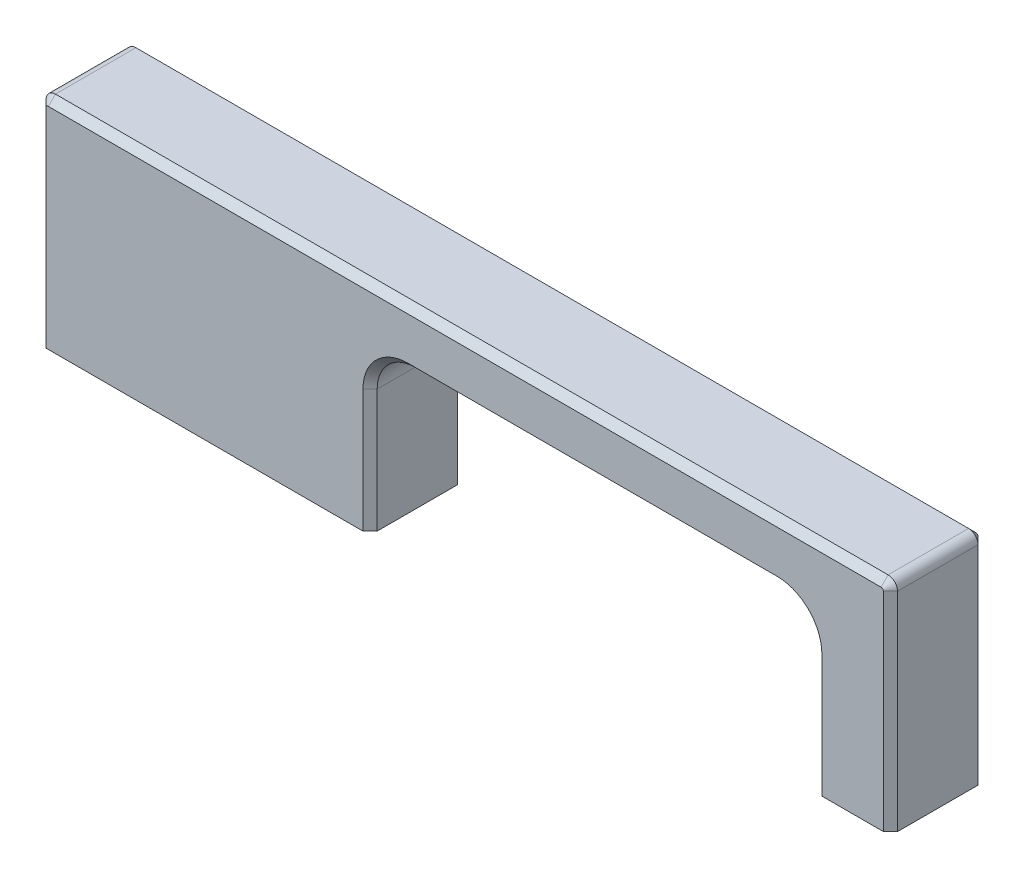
from build123d import *

# Parameters (mm, degrees)
EXTRUDE_1_DEPTH = 5
M4X0_7_1_D      = 3.3
M4X0_7_1_DEPTH  = 11.5
M4X0_7_1_TIP    = 0.991420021
FILLET_1_R      = 4
FILLET_2_R      = 1
CHAMFER_1_SIZE  = 0.75


with BuildPart() as part:
    # Sketch 1 → Extrude 1 (new, symmetric)
    with BuildSketch(Plane.XY):
        Polygon((45, 0), (37, 0), (37, 17), (-10, 17), (-10, 0), (-45, 0), (-45, 23), (45, 23), align=None)
    extrude(amount=EXTRUDE_1_DEPTH, both=True)

    # M4x0.7 _1
    with Locations(Plane(origin=(0, 0, 0), x_dir=(-1, 0, 0), z_dir=(0, -1, 0))):
        with Locations((-41, 0), (19, 0)):
            Hole(M4X0_7_1_D / 2, depth=M4X0_7_1_DEPTH)
            with Locations((0, 0, -(M4X0_7_1_DEPTH + M4X0_7_1_TIP / 2))):  # 118° drill point
                Cone(0, M4X0_7_1_D / 2, M4X0_7_1_TIP, mode=Mode.SUBTRACT)

    # Fillet 1
    fillet_1_edges = [part.edges().sort_by_distance(p)[0] for p in [
        (37, 17, 0),
        (-10, 17, 0),
    ]]
    fillet(fillet_1_edges, radius=FILLET_1_R)

    # Fillet 2
    fillet_2_edges = [part.edges().sort_by_distance(p)[0] for p in [
        (-45, 23, 0),
        (45, 23, 0),
    ]]
    fillet(fillet_2_edges, radius=FILLET_2_R)

    # Chamfer 1
    chamfer_1_edges = [part.edges().sort_by_distance(p)[0] for p in [
        (45, 11, -5),
        (-10, 6.5, 5),
        (37, 6.5, -5),
        (37, 6.5, 5),
        (13.5, 17, -5),
        (13.5, 17, 5),
        (35.828427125, 15.828427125, -5),
        (35.828427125, 15.828427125, 5),
        (-8.828427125, 15.828427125, -5),
        (-8.828427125, 15.828427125, 5),
        (0, 23, -5),
        (0, 23, 5),
        (-45, 11, -5),
        (-44.707106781, 22.707106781, -5),
        (44.707106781, 22.707106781, -5),
        (45, 11, 5),
        (-45, 11, 5),
        (-44.707106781, 22.707106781, 5),
        (44.707106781, 22.707106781, 5),
        (-10, 6.5, -5),
    ]]
    chamfer(chamfer_1_edges, length=CHAMFER_1_SIZE)


solid = part.part
